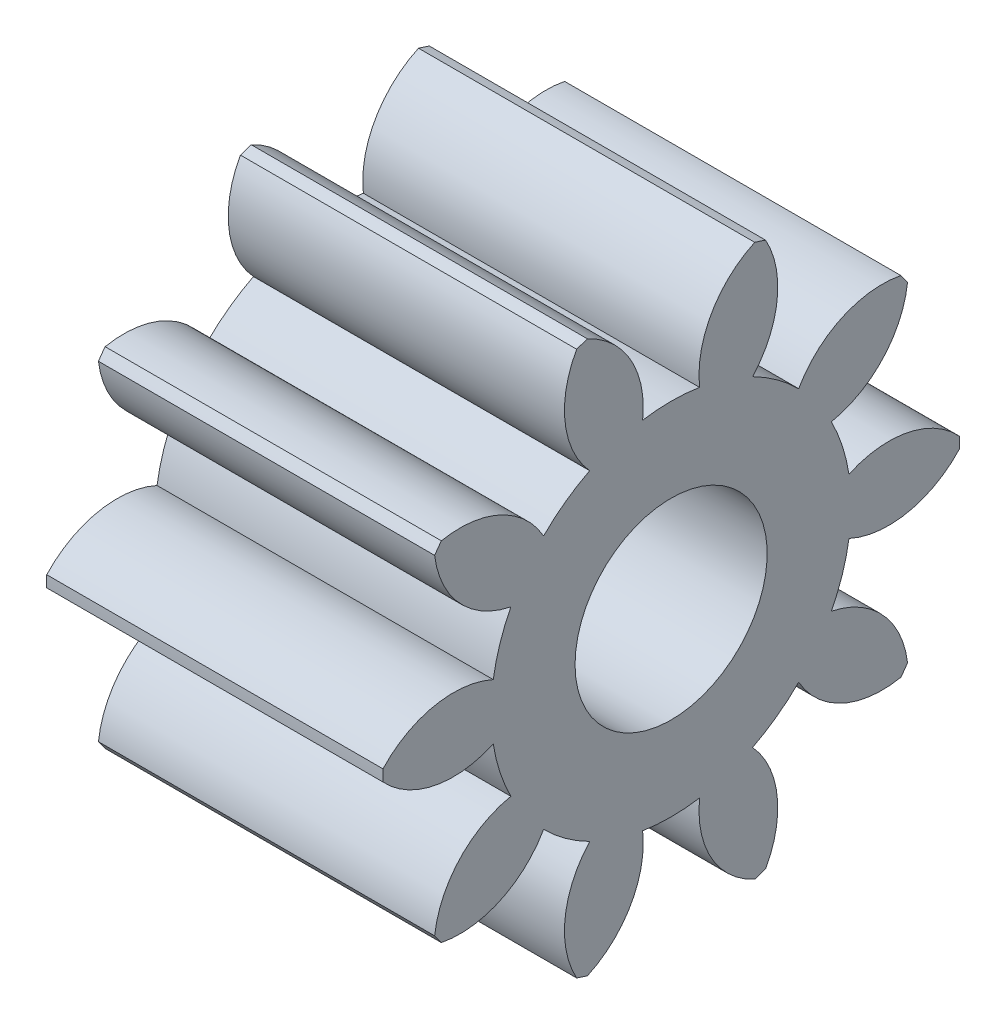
from build123d import *

# Parameters (mm, degrees)
BASPROSKE_W     = 3.5
BASPROSKE_H     = 3
TOOTHCUT_DEPTH  = 6.5
TEETHCUTS_COUNT = 10
TEETHCUTS_ANGLE = 324
BORSKE_R        = 1
BORE_DEPTH      = 50.0000508


with BuildPart() as part:
    # BasProSke → Base-Revolve (revolve)
    with BuildSketch(Plane(origin=(0, 0, 0), x_dir=(1, 0, 0), z_dir=(0, 1, 0)), mode=Mode.PRIVATE) as base_revolve_sk:
        with Locations((1.75, 1.5)):
            Rectangle(BASPROSKE_W, BASPROSKE_H)
    revolve(base_revolve_sk.sketch.rotate(Axis((-10, 0, 0), (1, 0, 0)), 180), axis=Axis((-10, 0, 0), (1, 0, 0)))

    # TooCutSke → ToothCut (cut, through all)
    with BuildSketch(Plane(origin=(0, 0, 0), x_dir=(0, 0, -1), z_dir=(1, 0, 0))):
        with BuildLine():
            ThreePointArc((0.296449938, 1.850403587), (0, 1.874), (-0.296449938, 1.850403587))
            ThreePointArc((-0.296449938, 1.850403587), (-0.428089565, 2.470295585), (-0.905889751, 2.886591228))
            ThreePointArc((-0.905889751, 2.886591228), (0, 3.0254), (0.905889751, 2.886591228))
            ThreePointArc((0.905889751, 2.886591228), (0.428089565, 2.470295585), (0.296449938, 1.850403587))
        make_face()
    toothcut = extrude(amount=TOOTHCUT_DEPTH, mode=Mode.SUBTRACT)

    # TeethCuts: ToothCut ×10 about axis
    teethcuts_axis = Axis((-10, 0, 0), (1, 0, 0))
    for i in range(1, TEETHCUTS_COUNT):
        add(toothcut.rotate(teethcuts_axis, i * TEETHCUTS_ANGLE / (TEETHCUTS_COUNT - 1)), mode=Mode.SUBTRACT)

    # BorSke → Bore (cut, symmetric)
    with BuildSketch(Plane(origin=(0, 0, 0), x_dir=(0, 0, -1), z_dir=(1, 0, 0))):
        with Locations(Location((0, 0, 0), (0, 0, 180))):
            Circle(BORSKE_R)
    extrude(amount=BORE_DEPTH, both=True, mode=Mode.SUBTRACT)


solid = part.part
